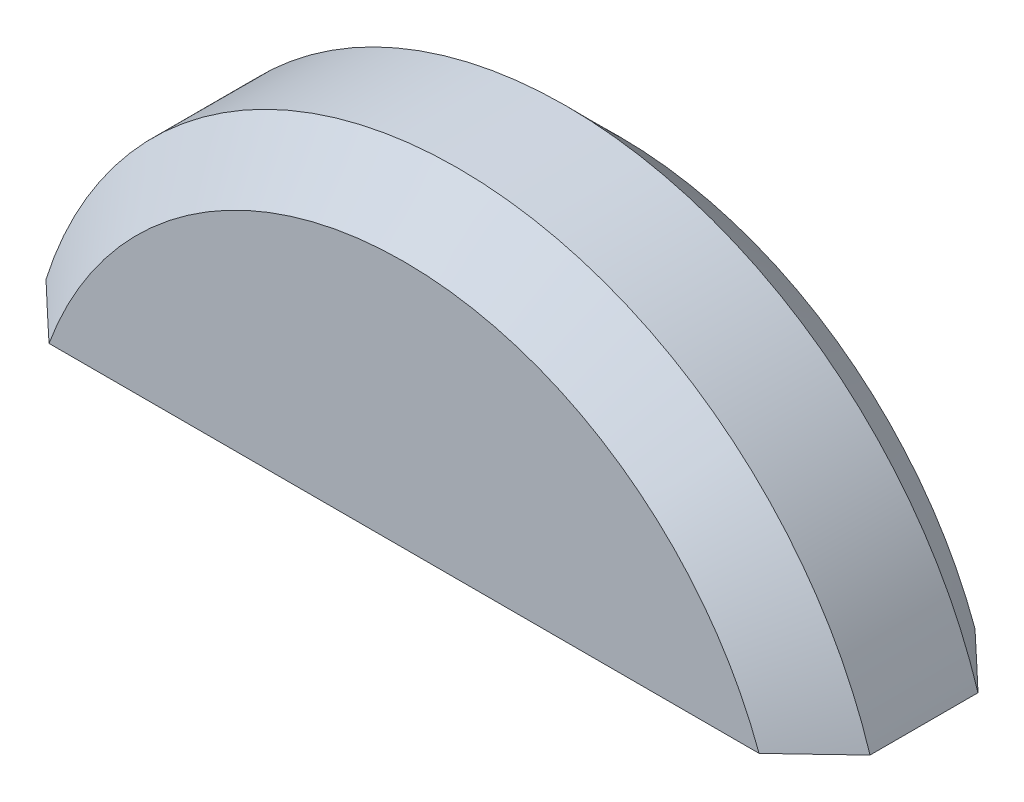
from build123d import *

# Parameters (mm, degrees)
EXTRUDE1_DEPTH = 1
CHAMFER1_SIZE  = 0.25


with BuildPart() as part:
    # body → Extrude1 (new body)
    with BuildSketch(Plane.XY):
        with BuildLine():
            Line((-1.907878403, 0.6), (1.907878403, 0.6))
            ThreePointArc((1.907878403, 0.6), (0, 2), (-1.907878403, 0.6))
        make_face()
    extrude(amount=EXTRUDE1_DEPTH)

    # Chamfer1
    chamfer1_edges = [part.edges().sort_by_distance(p)[0] for p in [
        (0, 2, 0),
        (0, 2, 1),
    ]]
    chamfer(chamfer1_edges, length=CHAMFER1_SIZE)


solid = part.part
